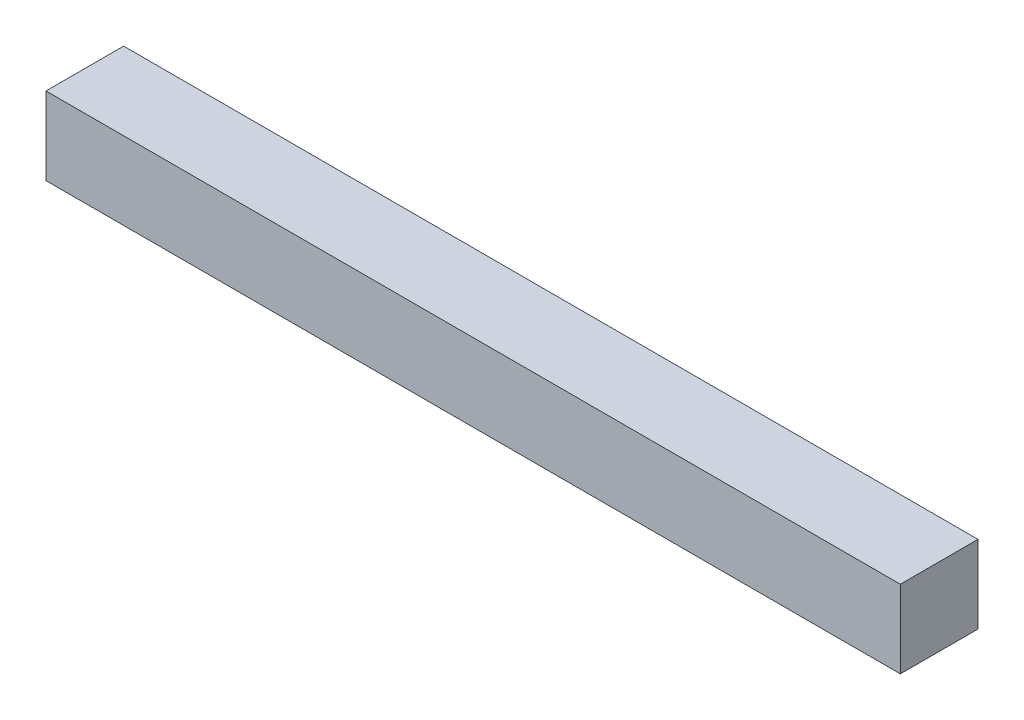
ISO-10303-21;
HEADER;
FILE_DESCRIPTION(('STEP AP214'),'2;1');
FILE_NAME('part.step','',(''),(''),'','','');
FILE_SCHEMA(('AUTOMOTIVE_DESIGN { 1 0 10303 214 1 1 1 1 }'));
ENDSEC;
DATA;
#1=APPLICATION_CONTEXT('core data for automotive mechanical design processes');
#2=APPLICATION_PROTOCOL_DEFINITION('international standard','automotive_design',2000,#1);
#3=PRODUCT_CONTEXT('',#1,'mechanical');
#4=PRODUCT('Part','Part','',(#3));
#5=PRODUCT_RELATED_PRODUCT_CATEGORY('part','',(#4));
#6=PRODUCT_DEFINITION_FORMATION('','',#4);
#7=PRODUCT_DEFINITION_CONTEXT('part definition',#1,'design');
#8=PRODUCT_DEFINITION('design','',#6,#7);
#9=PRODUCT_DEFINITION_SHAPE('','',#8);
#10=(LENGTH_UNIT() NAMED_UNIT(*) SI_UNIT(.MILLI.,.METRE.));
#11=(NAMED_UNIT(*) PLANE_ANGLE_UNIT() SI_UNIT($,.RADIAN.));
#12=(NAMED_UNIT(*) SI_UNIT($,.STERADIAN.) SOLID_ANGLE_UNIT());
#13=UNCERTAINTY_MEASURE_WITH_UNIT(LENGTH_MEASURE(1.E-05),#10,'distance_accuracy_value','');
#14=(GEOMETRIC_REPRESENTATION_CONTEXT(3) GLOBAL_UNCERTAINTY_ASSIGNED_CONTEXT((#13)) GLOBAL_UNIT_ASSIGNED_CONTEXT((#10,
#11,#12)) REPRESENTATION_CONTEXT('',''));
#15=CARTESIAN_POINT('',(0.,0.,0.));
#16=DIRECTION('',(0.,0.,1.));
#17=DIRECTION('',(1.,0.,0.));
#18=AXIS2_PLACEMENT_3D('',#15,#16,#17);
#19=CARTESIAN_POINT('',(-11.,1.,1.));
#20=DIRECTION('',(0.,0.,1.));
#21=DIRECTION('',(0.,-1.,0.));
#22=AXIS2_PLACEMENT_3D('',#19,#20,#21);
#23=PLANE('',#22);
#24=DIRECTION('',(1.,0.,0.));
#25=VECTOR('',#24,1.);
#26=CARTESIAN_POINT('',(-11.,-1.,1.));
#27=LINE('',#26,#25);
#28=CARTESIAN_POINT('',(-11.,-1.,1.));
#29=VERTEX_POINT('',#28);
#30=CARTESIAN_POINT('',(11.,-1.,1.));
#31=VERTEX_POINT('',#30);
#32=EDGE_CURVE('E36',#29,#31,#27,.T.);
#33=ORIENTED_EDGE('',*,*,#32,.T.);
#34=DIRECTION('',(0.,-1.,0.));
#35=VECTOR('',#34,1.);
#36=CARTESIAN_POINT('',(11.,1.,1.));
#37=LINE('',#36,#35);
#38=CARTESIAN_POINT('',(11.,1.,1.));
#39=VERTEX_POINT('',#38);
#40=EDGE_CURVE('E73',#39,#31,#37,.T.);
#41=ORIENTED_EDGE('',*,*,#40,.F.);
#42=DIRECTION('',(1.,0.,0.));
#43=VECTOR('',#42,1.);
#44=CARTESIAN_POINT('',(-11.,1.,1.));
#45=LINE('',#44,#43);
#46=CARTESIAN_POINT('',(-11.,1.,1.));
#47=VERTEX_POINT('',#46);
#48=EDGE_CURVE('E11',#47,#39,#45,.T.);
#49=ORIENTED_EDGE('',*,*,#48,.F.);
#50=DIRECTION('',(0.,-1.,0.));
#51=VECTOR('',#50,1.);
#52=CARTESIAN_POINT('',(-11.,1.,1.));
#53=LINE('',#52,#51);
#54=EDGE_CURVE('E74',#47,#29,#53,.T.);
#55=ORIENTED_EDGE('',*,*,#54,.T.);
#56=EDGE_LOOP('',(#33,#41,#49,#55));
#57=FACE_BOUND('',#56,.T.);
#58=ADVANCED_FACE('F33',(#57),#23,.T.);
#59=CARTESIAN_POINT('',(-11.,1.,1.));
#60=DIRECTION('',(0.,1.,0.));
#61=DIRECTION('',(0.,0.,1.));
#62=AXIS2_PLACEMENT_3D('',#59,#60,#61);
#63=PLANE('',#62);
#64=ORIENTED_EDGE('',*,*,#48,.T.);
#65=DIRECTION('',(0.,0.,1.));
#66=VECTOR('',#65,1.);
#67=CARTESIAN_POINT('',(11.,1.,1.));
#68=LINE('',#67,#66);
#69=CARTESIAN_POINT('',(11.,1.,-1.));
#70=VERTEX_POINT('',#69);
#71=EDGE_CURVE('E90',#70,#39,#68,.T.);
#72=ORIENTED_EDGE('',*,*,#71,.F.);
#73=DIRECTION('',(1.,0.,0.));
#74=VECTOR('',#73,1.);
#75=CARTESIAN_POINT('',(-11.,1.,-1.));
#76=LINE('',#75,#74);
#77=CARTESIAN_POINT('',(-11.,1.,-1.));
#78=VERTEX_POINT('',#77);
#79=EDGE_CURVE('E41',#78,#70,#76,.T.);
#80=ORIENTED_EDGE('',*,*,#79,.F.);
#81=DIRECTION('',(0.,0.,1.));
#82=VECTOR('',#81,1.);
#83=CARTESIAN_POINT('',(-11.,1.,1.));
#84=LINE('',#83,#82);
#85=EDGE_CURVE('E79',#78,#47,#84,.T.);
#86=ORIENTED_EDGE('',*,*,#85,.T.);
#87=EDGE_LOOP('',(#64,#72,#80,#86));
#88=FACE_BOUND('',#87,.T.);
#89=ADVANCED_FACE('F105',(#88),#63,.T.);
#90=CARTESIAN_POINT('',(-11.,1.,-1.));
#91=DIRECTION('',(0.,0.,-1.));
#92=DIRECTION('',(-1.,0.,0.));
#93=AXIS2_PLACEMENT_3D('',#90,#91,#92);
#94=PLANE('',#93);
#95=ORIENTED_EDGE('',*,*,#79,.T.);
#96=DIRECTION('',(0.,1.,0.));
#97=VECTOR('',#96,1.);
#98=CARTESIAN_POINT('',(11.,1.,-1.));
#99=LINE('',#98,#97);
#100=CARTESIAN_POINT('',(11.,-1.,-1.));
#101=VERTEX_POINT('',#100);
#102=EDGE_CURVE('E86',#101,#70,#99,.T.);
#103=ORIENTED_EDGE('',*,*,#102,.F.);
#104=DIRECTION('',(1.,0.,0.));
#105=VECTOR('',#104,1.);
#106=CARTESIAN_POINT('',(-11.,-1.,-1.));
#107=LINE('',#106,#105);
#108=CARTESIAN_POINT('',(-11.,-1.,-1.));
#109=VERTEX_POINT('',#108);
#110=EDGE_CURVE('E78',#109,#101,#107,.T.);
#111=ORIENTED_EDGE('',*,*,#110,.F.);
#112=DIRECTION('',(0.,1.,0.));
#113=VECTOR('',#112,1.);
#114=CARTESIAN_POINT('',(-11.,1.,-1.));
#115=LINE('',#114,#113);
#116=EDGE_CURVE('E98',#109,#78,#115,.T.);
#117=ORIENTED_EDGE('',*,*,#116,.T.);
#118=EDGE_LOOP('',(#95,#103,#111,#117));
#119=FACE_BOUND('',#118,.T.);
#120=ADVANCED_FACE('F102',(#119),#94,.T.);
#121=CARTESIAN_POINT('',(-11.,-1.,1.));
#122=DIRECTION('',(0.,-1.,0.));
#123=DIRECTION('',(0.,0.,-1.));
#124=AXIS2_PLACEMENT_3D('',#121,#122,#123);
#125=PLANE('',#124);
#126=ORIENTED_EDGE('',*,*,#110,.T.);
#127=DIRECTION('',(0.,0.,-1.));
#128=VECTOR('',#127,1.);
#129=CARTESIAN_POINT('',(11.,-1.,1.));
#130=LINE('',#129,#128);
#131=EDGE_CURVE('E81',#31,#101,#130,.T.);
#132=ORIENTED_EDGE('',*,*,#131,.F.);
#133=ORIENTED_EDGE('',*,*,#32,.F.);
#134=DIRECTION('',(0.,0.,-1.));
#135=VECTOR('',#134,1.);
#136=CARTESIAN_POINT('',(-11.,-1.,1.));
#137=LINE('',#136,#135);
#138=EDGE_CURVE('E96',#29,#109,#137,.T.);
#139=ORIENTED_EDGE('',*,*,#138,.T.);
#140=EDGE_LOOP('',(#126,#132,#133,#139));
#141=FACE_BOUND('',#140,.T.);
#142=ADVANCED_FACE('F82',(#141),#125,.T.);
#143=CARTESIAN_POINT('',(-11.,0.,0.));
#144=DIRECTION('',(1.,0.,0.));
#145=DIRECTION('',(0.,0.,-1.));
#146=AXIS2_PLACEMENT_3D('',#143,#144,#145);
#147=PLANE('',#146);
#148=ORIENTED_EDGE('',*,*,#54,.F.);
#149=ORIENTED_EDGE('',*,*,#85,.F.);
#150=ORIENTED_EDGE('',*,*,#116,.F.);
#151=ORIENTED_EDGE('',*,*,#138,.F.);
#152=EDGE_LOOP('',(#148,#149,#150,#151));
#153=FACE_BOUND('',#152,.T.);
#154=ADVANCED_FACE('F107',(#153),#147,.F.);
#155=CARTESIAN_POINT('',(11.,0.,0.));
#156=DIRECTION('',(1.,0.,0.));
#157=DIRECTION('',(0.,0.,-1.));
#158=AXIS2_PLACEMENT_3D('',#155,#156,#157);
#159=PLANE('',#158);
#160=ORIENTED_EDGE('',*,*,#40,.T.);
#161=ORIENTED_EDGE('',*,*,#131,.T.);
#162=ORIENTED_EDGE('',*,*,#102,.T.);
#163=ORIENTED_EDGE('',*,*,#71,.T.);
#164=EDGE_LOOP('',(#160,#161,#162,#163));
#165=FACE_BOUND('',#164,.T.);
#166=ADVANCED_FACE('F89',(#165),#159,.T.);
#167=CLOSED_SHELL('',(#58,#89,#120,#142,#154,#166));
#168=MANIFOLD_SOLID_BREP('B2',#167);
#169=ADVANCED_BREP_SHAPE_REPRESENTATION('',(#18,#168),#14);
#170=SHAPE_DEFINITION_REPRESENTATION(#9,#169);
ENDSEC;
END-ISO-10303-21;
